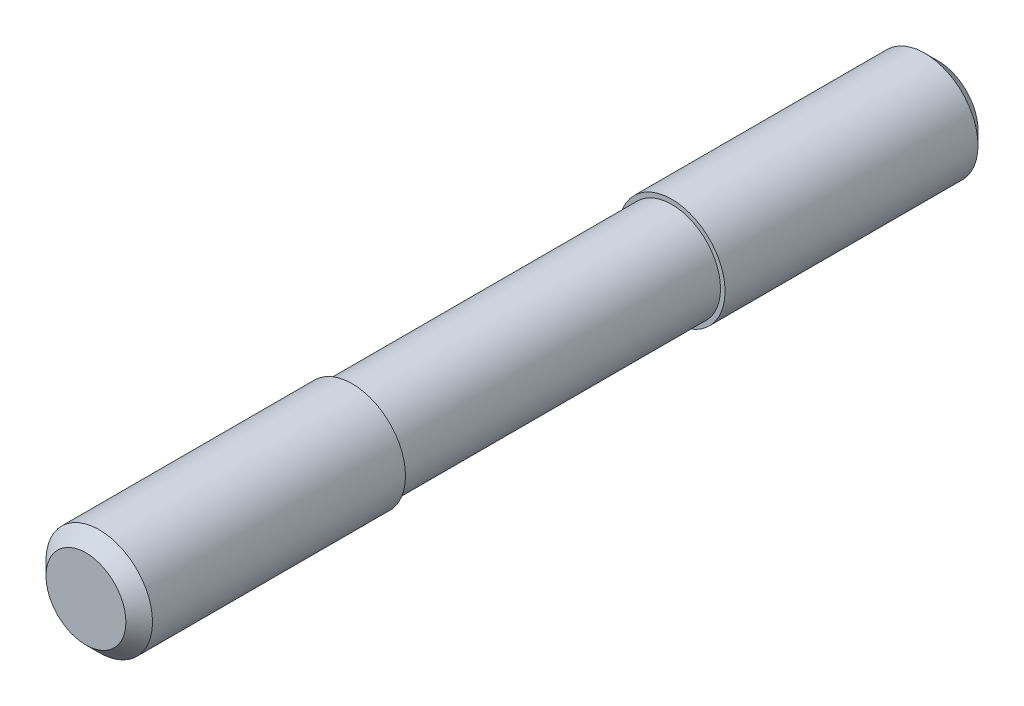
ISO-10303-21;
HEADER;
FILE_DESCRIPTION(('STEP AP214'),'2;1');
FILE_NAME('part.step','',(''),(''),'','','');
FILE_SCHEMA(('AUTOMOTIVE_DESIGN { 1 0 10303 214 1 1 1 1 }'));
ENDSEC;
DATA;
#1=APPLICATION_CONTEXT('core data for automotive mechanical design processes');
#2=APPLICATION_PROTOCOL_DEFINITION('international standard','automotive_design',2000,#1);
#3=PRODUCT_CONTEXT('',#1,'mechanical');
#4=PRODUCT('Part','Part','',(#3));
#5=PRODUCT_RELATED_PRODUCT_CATEGORY('part','',(#4));
#6=PRODUCT_DEFINITION_FORMATION('','',#4);
#7=PRODUCT_DEFINITION_CONTEXT('part definition',#1,'design');
#8=PRODUCT_DEFINITION('design','',#6,#7);
#9=PRODUCT_DEFINITION_SHAPE('','',#8);
#10=(LENGTH_UNIT() NAMED_UNIT(*) SI_UNIT(.MILLI.,.METRE.));
#11=(NAMED_UNIT(*) PLANE_ANGLE_UNIT() SI_UNIT($,.RADIAN.));
#12=(NAMED_UNIT(*) SI_UNIT($,.STERADIAN.) SOLID_ANGLE_UNIT());
#13=UNCERTAINTY_MEASURE_WITH_UNIT(LENGTH_MEASURE(1.E-05),#10,'distance_accuracy_value','');
#14=(GEOMETRIC_REPRESENTATION_CONTEXT(3) GLOBAL_UNCERTAINTY_ASSIGNED_CONTEXT((#13)) GLOBAL_UNIT_ASSIGNED_CONTEXT((#10,
#11,#12)) REPRESENTATION_CONTEXT('',''));
#15=CARTESIAN_POINT('',(0.,0.,0.));
#16=DIRECTION('',(0.,0.,1.));
#17=DIRECTION('',(1.,0.,0.));
#18=AXIS2_PLACEMENT_3D('',#15,#16,#17);
#19=CARTESIAN_POINT('',(0.,0.,0.));
#20=DIRECTION('',(0.,0.,1.));
#21=DIRECTION('',(1.,0.,0.));
#22=AXIS2_PLACEMENT_3D('',#19,#20,#21);
#23=PLANE('',#22);
#24=CARTESIAN_POINT('',(0.,0.,0.));
#25=DIRECTION('',(0.,0.,1.));
#26=DIRECTION('',(1.,0.,0.));
#27=AXIS2_PLACEMENT_3D('',#24,#25,#26);
#28=CIRCLE('',#27,7.5);
#29=CARTESIAN_POINT('',(7.5,0.,0.));
#30=VERTEX_POINT('',#29);
#31=EDGE_CURVE('E8',#30,#30,#28,.T.);
#32=ORIENTED_EDGE('',*,*,#31,.F.);
#33=EDGE_LOOP('',(#32));
#34=FACE_BOUND('',#33,.T.);
#35=ADVANCED_FACE('F12',(#34),#23,.F.);
#36=CARTESIAN_POINT('',(0.,0.,2.5));
#37=DIRECTION('',(0.,0.,1.));
#38=DIRECTION('',(1.,0.,0.));
#39=AXIS2_PLACEMENT_3D('',#36,#37,#38);
#40=CONICAL_SURFACE('',#39,10.,0.785398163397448);
#41=ORIENTED_EDGE('',*,*,#31,.T.);
#42=EDGE_LOOP('',(#41));
#43=FACE_BOUND('',#42,.T.);
#44=CARTESIAN_POINT('',(0.,0.,2.5));
#45=DIRECTION('',(0.,0.,1.));
#46=DIRECTION('',(1.,0.,0.));
#47=AXIS2_PLACEMENT_3D('',#44,#45,#46);
#48=CIRCLE('',#47,10.);
#49=CARTESIAN_POINT('',(10.,0.,2.5));
#50=VERTEX_POINT('',#49);
#51=EDGE_CURVE('E18',#50,#50,#48,.T.);
#52=ORIENTED_EDGE('',*,*,#51,.F.);
#53=EDGE_LOOP('',(#52));
#54=FACE_BOUND('',#53,.T.);
#55=ADVANCED_FACE('F62',(#43,#54),#40,.T.);
#56=CARTESIAN_POINT('',(0.,0.,70.));
#57=DIRECTION('',(0.,0.,1.));
#58=DIRECTION('',(1.,0.,0.));
#59=AXIS2_PLACEMENT_3D('',#56,#57,#58);
#60=CYLINDRICAL_SURFACE('',#59,10.);
#61=CARTESIAN_POINT('',(0.,0.,50.));
#62=DIRECTION('',(0.,0.,1.));
#63=DIRECTION('',(1.,0.,0.));
#64=AXIS2_PLACEMENT_3D('',#61,#62,#63);
#65=CIRCLE('',#64,10.);
#66=CARTESIAN_POINT('',(10.,0.,50.));
#67=VERTEX_POINT('',#66);
#68=EDGE_CURVE('E22',#67,#67,#65,.T.);
#69=ORIENTED_EDGE('',*,*,#68,.F.);
#70=EDGE_LOOP('',(#69));
#71=FACE_BOUND('',#70,.T.);
#72=ORIENTED_EDGE('',*,*,#51,.T.);
#73=EDGE_LOOP('',(#72));
#74=FACE_BOUND('',#73,.T.);
#75=ADVANCED_FACE('F68',(#71,#74),#60,.T.);
#76=CARTESIAN_POINT('',(10.,0.,50.));
#77=DIRECTION('',(0.,0.,-1.));
#78=DIRECTION('',(-1.,0.,0.));
#79=AXIS2_PLACEMENT_3D('',#76,#77,#78);
#80=PLANE('',#79);
#81=CARTESIAN_POINT('',(0.,0.,50.));
#82=DIRECTION('',(0.,0.,1.));
#83=DIRECTION('',(1.,0.,0.));
#84=AXIS2_PLACEMENT_3D('',#81,#82,#83);
#85=CIRCLE('',#84,9.15);
#86=CARTESIAN_POINT('',(9.15,0.,50.));
#87=VERTEX_POINT('',#86);
#88=EDGE_CURVE('E26',#87,#87,#85,.T.);
#89=ORIENTED_EDGE('',*,*,#88,.F.);
#90=EDGE_LOOP('',(#89));
#91=FACE_BOUND('',#90,.T.);
#92=ORIENTED_EDGE('',*,*,#68,.T.);
#93=EDGE_LOOP('',(#92));
#94=FACE_BOUND('',#93,.T.);
#95=ADVANCED_FACE('F73',(#91,#94),#80,.F.);
#96=CARTESIAN_POINT('',(0.,0.,70.));
#97=DIRECTION('',(0.,0.,1.));
#98=DIRECTION('',(1.,0.,0.));
#99=AXIS2_PLACEMENT_3D('',#96,#97,#98);
#100=CYLINDRICAL_SURFACE('',#99,9.15);
#101=CARTESIAN_POINT('',(0.,0.,110.));
#102=DIRECTION('',(0.,0.,1.));
#103=DIRECTION('',(1.,0.,0.));
#104=AXIS2_PLACEMENT_3D('',#101,#102,#103);
#105=CIRCLE('',#104,9.15);
#106=CARTESIAN_POINT('',(9.15,0.,110.));
#107=VERTEX_POINT('',#106);
#108=EDGE_CURVE('E31',#107,#107,#105,.T.);
#109=ORIENTED_EDGE('',*,*,#108,.F.);
#110=EDGE_LOOP('',(#109));
#111=FACE_BOUND('',#110,.T.);
#112=ORIENTED_EDGE('',*,*,#88,.T.);
#113=EDGE_LOOP('',(#112));
#114=FACE_BOUND('',#113,.T.);
#115=ADVANCED_FACE('F80',(#111,#114),#100,.T.);
#116=CARTESIAN_POINT('',(9.15,0.,110.));
#117=DIRECTION('',(0.,0.,1.));
#118=DIRECTION('',(1.,0.,0.));
#119=AXIS2_PLACEMENT_3D('',#116,#117,#118);
#120=PLANE('',#119);
#121=CARTESIAN_POINT('',(0.,0.,110.));
#122=DIRECTION('',(0.,0.,1.));
#123=DIRECTION('',(1.,0.,0.));
#124=AXIS2_PLACEMENT_3D('',#121,#122,#123);
#125=CIRCLE('',#124,10.);
#126=CARTESIAN_POINT('',(10.,0.,110.));
#127=VERTEX_POINT('',#126);
#128=EDGE_CURVE('E34',#127,#127,#125,.T.);
#129=ORIENTED_EDGE('',*,*,#128,.F.);
#130=EDGE_LOOP('',(#129));
#131=FACE_BOUND('',#130,.T.);
#132=ORIENTED_EDGE('',*,*,#108,.T.);
#133=EDGE_LOOP('',(#132));
#134=FACE_BOUND('',#133,.T.);
#135=ADVANCED_FACE('F58',(#131,#134),#120,.F.);
#136=CARTESIAN_POINT('',(0.,0.,70.));
#137=DIRECTION('',(0.,0.,1.));
#138=DIRECTION('',(1.,0.,0.));
#139=AXIS2_PLACEMENT_3D('',#136,#137,#138);
#140=CYLINDRICAL_SURFACE('',#139,10.);
#141=CARTESIAN_POINT('',(0.,0.,157.5));
#142=DIRECTION('',(0.,0.,1.));
#143=DIRECTION('',(1.,0.,0.));
#144=AXIS2_PLACEMENT_3D('',#141,#142,#143);
#145=CIRCLE('',#144,10.);
#146=CARTESIAN_POINT('',(10.,0.,157.5));
#147=VERTEX_POINT('',#146);
#148=EDGE_CURVE('E37',#147,#147,#145,.T.);
#149=ORIENTED_EDGE('',*,*,#148,.F.);
#150=EDGE_LOOP('',(#149));
#151=FACE_BOUND('',#150,.T.);
#152=ORIENTED_EDGE('',*,*,#128,.T.);
#153=EDGE_LOOP('',(#152));
#154=FACE_BOUND('',#153,.T.);
#155=ADVANCED_FACE('F48',(#151,#154),#140,.T.);
#156=CARTESIAN_POINT('',(0.,0.,160.));
#157=DIRECTION('',(0.,0.,-1.));
#158=DIRECTION('',(-1.,0.,0.));
#159=AXIS2_PLACEMENT_3D('',#156,#157,#158);
#160=CONICAL_SURFACE('',#159,7.5,0.785398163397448);
#161=ORIENTED_EDGE('',*,*,#148,.T.);
#162=EDGE_LOOP('',(#161));
#163=FACE_BOUND('',#162,.T.);
#164=CARTESIAN_POINT('',(0.,0.,160.));
#165=DIRECTION('',(0.,0.,1.));
#166=DIRECTION('',(1.,0.,0.));
#167=AXIS2_PLACEMENT_3D('',#164,#165,#166);
#168=CIRCLE('',#167,7.5);
#169=CARTESIAN_POINT('',(7.5,0.,160.));
#170=VERTEX_POINT('',#169);
#171=EDGE_CURVE('E40',#170,#170,#168,.T.);
#172=ORIENTED_EDGE('',*,*,#171,.F.);
#173=EDGE_LOOP('',(#172));
#174=FACE_BOUND('',#173,.T.);
#175=ADVANCED_FACE('F46',(#163,#174),#160,.T.);
#176=CARTESIAN_POINT('',(7.5,0.,160.));
#177=DIRECTION('',(0.,0.,-1.));
#178=DIRECTION('',(-1.,0.,0.));
#179=AXIS2_PLACEMENT_3D('',#176,#177,#178);
#180=PLANE('',#179);
#181=ORIENTED_EDGE('',*,*,#171,.T.);
#182=EDGE_LOOP('',(#181));
#183=FACE_BOUND('',#182,.T.);
#184=ADVANCED_FACE('F44',(#183),#180,.F.);
#185=CLOSED_SHELL('',(#35,#55,#75,#95,#115,#135,#155,#175,#184));
#186=MANIFOLD_SOLID_BREP('B1',#185);
#187=ADVANCED_BREP_SHAPE_REPRESENTATION('',(#18,#186),#14);
#188=SHAPE_DEFINITION_REPRESENTATION(#9,#187);
ENDSEC;
END-ISO-10303-21;
